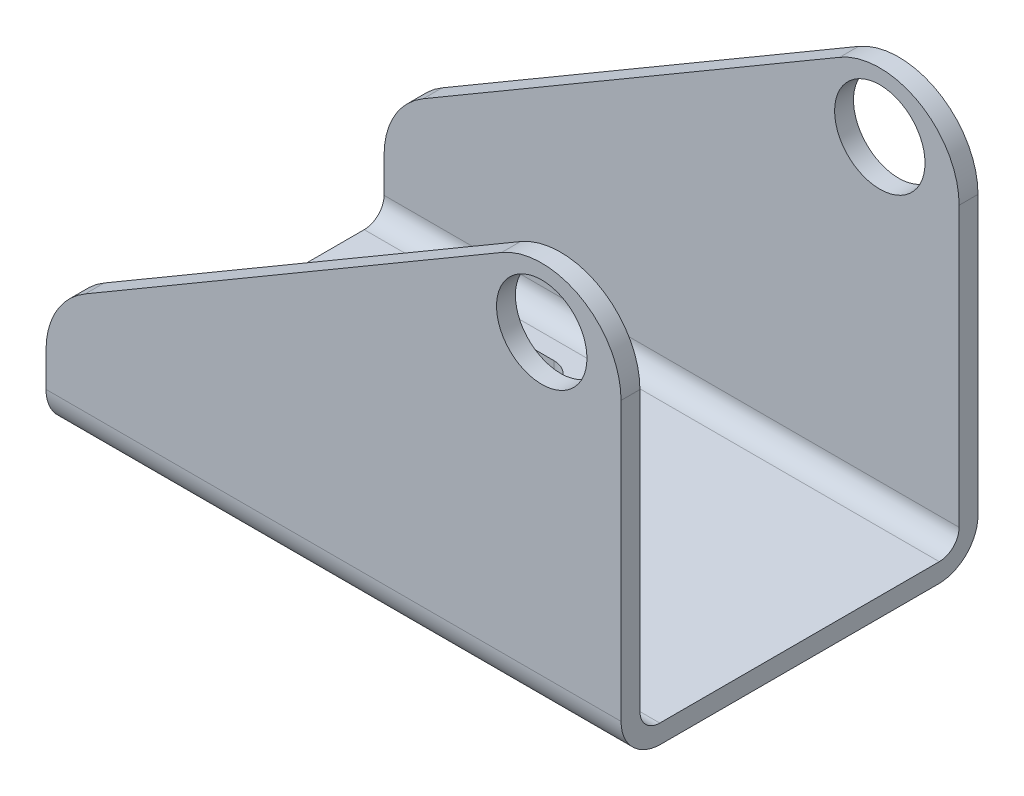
ISO-10303-21;
HEADER;
FILE_DESCRIPTION(('STEP AP214'),'2;1');
FILE_NAME('part.step','',(''),(''),'','','');
FILE_SCHEMA(('AUTOMOTIVE_DESIGN { 1 0 10303 214 1 1 1 1 }'));
ENDSEC;
DATA;
#1=APPLICATION_CONTEXT('core data for automotive mechanical design processes');
#2=APPLICATION_PROTOCOL_DEFINITION('international standard','automotive_design',2000,#1);
#3=PRODUCT_CONTEXT('',#1,'mechanical');
#4=PRODUCT('Part','Part','',(#3));
#5=PRODUCT_RELATED_PRODUCT_CATEGORY('part','',(#4));
#6=PRODUCT_DEFINITION_FORMATION('','',#4);
#7=PRODUCT_DEFINITION_CONTEXT('part definition',#1,'design');
#8=PRODUCT_DEFINITION('design','',#6,#7);
#9=PRODUCT_DEFINITION_SHAPE('','',#8);
#10=(LENGTH_UNIT() NAMED_UNIT(*) SI_UNIT(.MILLI.,.METRE.));
#11=(NAMED_UNIT(*) PLANE_ANGLE_UNIT() SI_UNIT($,.RADIAN.));
#12=(NAMED_UNIT(*) SI_UNIT($,.STERADIAN.) SOLID_ANGLE_UNIT());
#13=UNCERTAINTY_MEASURE_WITH_UNIT(LENGTH_MEASURE(1.E-05),#10,'distance_accuracy_value','');
#14=(GEOMETRIC_REPRESENTATION_CONTEXT(3) GLOBAL_UNCERTAINTY_ASSIGNED_CONTEXT((#13)) GLOBAL_UNIT_ASSIGNED_CONTEXT((#10,
#11,#12)) REPRESENTATION_CONTEXT('',''));
#15=CARTESIAN_POINT('',(0.,0.,0.));
#16=DIRECTION('',(0.,0.,1.));
#17=DIRECTION('',(1.,0.,0.));
#18=AXIS2_PLACEMENT_3D('',#15,#16,#17);
#19=CARTESIAN_POINT('',(0.,0.,-28.575));
#20=DIRECTION('',(0.,0.,-1.));
#21=DIRECTION('',(-1.,0.,0.));
#22=AXIS2_PLACEMENT_3D('',#19,#20,#21);
#23=PLANE('',#22);
#24=DIRECTION('',(0.,1.,0.));
#25=VECTOR('',#24,1.);
#26=CARTESIAN_POINT('',(92.075,73.025,-28.575));
#27=LINE('',#26,#25);
#28=CARTESIAN_POINT('',(92.075,6.35000000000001,-28.575));
#29=VERTEX_POINT('',#28);
#30=CARTESIAN_POINT('',(92.075,50.8589137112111,-28.575));
#31=VERTEX_POINT('',#30);
#32=EDGE_CURVE('E332',#29,#31,#27,.T.);
#33=ORIENTED_EDGE('',*,*,#32,.F.);
#34=DIRECTION('',(1.,0.,0.));
#35=VECTOR('',#34,1.);
#36=CARTESIAN_POINT('',(0.,6.35,-28.575));
#37=LINE('',#36,#35);
#38=CARTESIAN_POINT('',(0.,6.35,-28.575));
#39=VERTEX_POINT('',#38);
#40=EDGE_CURVE('E402',#29,#39,#37,.F.);
#41=ORIENTED_EDGE('',*,*,#40,.T.);
#42=DIRECTION('',(0.,-1.,0.));
#43=VECTOR('',#42,1.);
#44=CARTESIAN_POINT('',(0.,0.,-28.575));
#45=LINE('',#44,#43);
#46=CARTESIAN_POINT('',(0.,11.7735688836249,-28.575));
#47=VERTEX_POINT('',#46);
#48=EDGE_CURVE('E342',#47,#39,#45,.T.);
#49=ORIENTED_EDGE('',*,*,#48,.F.);
#50=CARTESIAN_POINT('',(12.7,11.7735688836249,-28.575));
#51=DIRECTION('',(0.,0.,-1.));
#52=DIRECTION('',(-1.,0.,0.));
#53=AXIS2_PLACEMENT_3D('',#50,#51,#52);
#54=CIRCLE('',#53,12.7);
#55=CARTESIAN_POINT('',(6.27736235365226,22.7298331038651,-28.575));
#56=VERTEX_POINT('',#55);
#57=EDGE_CURVE('E376',#47,#56,#54,.T.);
#58=ORIENTED_EDGE('',*,*,#57,.T.);
#59=DIRECTION('',(-0.862697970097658,-0.50571949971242,0.));
#60=VECTOR('',#59,1.);
#61=CARTESIAN_POINT('',(0.,19.05,-28.575));
#62=LINE('',#61,#60);
#63=CARTESIAN_POINT('',(72.9523623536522,61.8151779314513,-28.575));
#64=VERTEX_POINT('',#63);
#65=EDGE_CURVE('E339',#64,#56,#62,.T.);
#66=ORIENTED_EDGE('',*,*,#65,.F.);
#67=CARTESIAN_POINT('',(79.375,50.8589137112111,-28.575));
#68=DIRECTION('',(0.,0.,-1.));
#69=DIRECTION('',(-1.,0.,0.));
#70=AXIS2_PLACEMENT_3D('',#67,#68,#69);
#71=CIRCLE('',#70,12.7);
#72=EDGE_CURVE('E363',#64,#31,#71,.T.);
#73=ORIENTED_EDGE('',*,*,#72,.T.);
#74=EDGE_LOOP('',(#33,#41,#49,#58,#66,#73));
#75=FACE_BOUND('',#74,.T.);
#76=CARTESIAN_POINT('',(79.375,53.975,-28.575));
#77=DIRECTION('',(0.,0.,1.));
#78=DIRECTION('',(1.,0.,0.));
#79=AXIS2_PLACEMENT_3D('',#76,#77,#78);
#80=CIRCLE('',#79,7.23899999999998);
#81=CARTESIAN_POINT('',(86.614,53.975,-28.575));
#82=VERTEX_POINT('',#81);
#83=EDGE_CURVE('E288',#82,#82,#80,.T.);
#84=ORIENTED_EDGE('',*,*,#83,.T.);
#85=EDGE_LOOP('',(#84));
#86=FACE_BOUND('',#85,.T.);
#87=ADVANCED_FACE('F31',(#75,#86),#23,.T.);
#88=CARTESIAN_POINT('',(92.075,73.025,28.575));
#89=DIRECTION('',(-1.,0.,0.));
#90=DIRECTION('',(0.,-1.,0.));
#91=AXIS2_PLACEMENT_3D('',#88,#89,#90);
#92=PLANE('',#91);
#93=DIRECTION('',(0.,1.,0.));
#94=VECTOR('',#93,1.);
#95=CARTESIAN_POINT('',(92.075,73.025,28.575));
#96=LINE('',#95,#94);
#97=CARTESIAN_POINT('',(92.075,6.35000000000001,28.575));
#98=VERTEX_POINT('',#97);
#99=CARTESIAN_POINT('',(92.075,50.8589137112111,28.575));
#100=VERTEX_POINT('',#99);
#101=EDGE_CURVE('E345',#98,#100,#96,.T.);
#102=ORIENTED_EDGE('',*,*,#101,.F.);
#103=CARTESIAN_POINT('',(92.075,6.35,22.225));
#104=DIRECTION('',(-1.,0.,0.));
#105=DIRECTION('',(0.,-1.,0.));
#106=AXIS2_PLACEMENT_3D('',#103,#104,#105);
#107=CIRCLE('',#106,6.35);
#108=CARTESIAN_POINT('',(92.075,0.,22.225));
#109=VERTEX_POINT('',#108);
#110=EDGE_CURVE('E391',#98,#109,#107,.F.);
#111=ORIENTED_EDGE('',*,*,#110,.T.);
#112=DIRECTION('',(0.,0.,-1.));
#113=VECTOR('',#112,1.);
#114=CARTESIAN_POINT('',(92.075,0.,28.575));
#115=LINE('',#114,#113);
#116=CARTESIAN_POINT('',(92.075,0.,-22.225));
#117=VERTEX_POINT('',#116);
#118=EDGE_CURVE('E356',#109,#117,#115,.T.);
#119=ORIENTED_EDGE('',*,*,#118,.T.);
#120=CARTESIAN_POINT('',(92.075,6.35,-22.225));
#121=DIRECTION('',(-1.,0.,0.));
#122=DIRECTION('',(0.,-1.,0.));
#123=AXIS2_PLACEMENT_3D('',#120,#121,#122);
#124=CIRCLE('',#123,6.35);
#125=EDGE_CURVE('E389',#117,#29,#124,.F.);
#126=ORIENTED_EDGE('',*,*,#125,.T.);
#127=ORIENTED_EDGE('',*,*,#32,.T.);
#128=DIRECTION('',(0.,0.,-1.));
#129=VECTOR('',#128,1.);
#130=CARTESIAN_POINT('',(92.075,50.8589137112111,28.575));
#131=LINE('',#130,#129);
#132=CARTESIAN_POINT('',(92.075,50.8589137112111,-25.5524));
#133=VERTEX_POINT('',#132);
#134=EDGE_CURVE('E367',#31,#133,#131,.F.);
#135=ORIENTED_EDGE('',*,*,#134,.T.);
#136=DIRECTION('',(0.,1.,0.));
#137=VECTOR('',#136,1.);
#138=CARTESIAN_POINT('',(92.075,0.,-25.5524));
#139=LINE('',#138,#137);
#140=CARTESIAN_POINT('',(92.075,6.1976,-25.5524));
#141=VERTEX_POINT('',#140);
#142=EDGE_CURVE('E304',#141,#133,#139,.T.);
#143=ORIENTED_EDGE('',*,*,#142,.F.);
#144=CARTESIAN_POINT('',(92.075,6.1976,-22.3774));
#145=DIRECTION('',(-1.,0.,0.));
#146=DIRECTION('',(0.,-1.,0.));
#147=AXIS2_PLACEMENT_3D('',#144,#145,#146);
#148=CIRCLE('',#147,3.175);
#149=CARTESIAN_POINT('',(92.075,3.0226,-22.3774));
#150=VERTEX_POINT('',#149);
#151=EDGE_CURVE('E414',#141,#150,#148,.T.);
#152=ORIENTED_EDGE('',*,*,#151,.T.);
#153=DIRECTION('',(0.,0.,-1.));
#154=VECTOR('',#153,1.);
#155=CARTESIAN_POINT('',(92.075,3.0226,28.575));
#156=LINE('',#155,#154);
#157=CARTESIAN_POINT('',(92.075,3.0226,22.3774));
#158=VERTEX_POINT('',#157);
#159=EDGE_CURVE('E305',#158,#150,#156,.T.);
#160=ORIENTED_EDGE('',*,*,#159,.F.);
#161=CARTESIAN_POINT('',(92.075,6.1976,22.3774));
#162=DIRECTION('',(-1.,0.,0.));
#163=DIRECTION('',(0.,-1.,0.));
#164=AXIS2_PLACEMENT_3D('',#161,#162,#163);
#165=CIRCLE('',#164,3.175);
#166=CARTESIAN_POINT('',(92.075,6.1976,25.5524));
#167=VERTEX_POINT('',#166);
#168=EDGE_CURVE('E418',#158,#167,#165,.T.);
#169=ORIENTED_EDGE('',*,*,#168,.T.);
#170=DIRECTION('',(0.,1.,0.));
#171=VECTOR('',#170,1.);
#172=CARTESIAN_POINT('',(92.075,0.,25.5524));
#173=LINE('',#172,#171);
#174=CARTESIAN_POINT('',(92.075,50.8589137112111,25.5524));
#175=VERTEX_POINT('',#174);
#176=EDGE_CURVE('E323',#167,#175,#173,.T.);
#177=ORIENTED_EDGE('',*,*,#176,.T.);
#178=EDGE_CURVE('E366',#175,#100,#131,.F.);
#179=ORIENTED_EDGE('',*,*,#178,.T.);
#180=EDGE_LOOP('',(#102,#111,#119,#126,#127,#135,#143,#152,#160,#169,#177,#179));
#181=FACE_BOUND('',#180,.T.);
#182=ADVANCED_FACE('F518',(#181),#92,.F.);
#183=CARTESIAN_POINT('',(0.,19.05,28.575));
#184=DIRECTION('',(0.50571949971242,-0.862697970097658,0.));
#185=DIRECTION('',(0.862697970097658,0.50571949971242,0.));
#186=AXIS2_PLACEMENT_3D('',#183,#184,#185);
#187=PLANE('',#186);
#188=DIRECTION('',(-0.862697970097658,-0.50571949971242,0.));
#189=VECTOR('',#188,1.);
#190=CARTESIAN_POINT('',(-8.31119469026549,14.1779203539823,-25.5524));
#191=LINE('',#190,#189);
#192=CARTESIAN_POINT('',(72.9523623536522,61.8151779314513,-25.5524));
#193=VERTEX_POINT('',#192);
#194=CARTESIAN_POINT('',(6.27736235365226,22.7298331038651,-25.5524));
#195=VERTEX_POINT('',#194);
#196=EDGE_CURVE('E311',#193,#195,#191,.T.);
#197=ORIENTED_EDGE('',*,*,#196,.F.);
#198=DIRECTION('',(0.,0.,-1.));
#199=VECTOR('',#198,1.);
#200=CARTESIAN_POINT('',(72.9523623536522,61.8151779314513,28.575));
#201=LINE('',#200,#199);
#202=EDGE_CURVE('E359',#193,#64,#201,.T.);
#203=ORIENTED_EDGE('',*,*,#202,.T.);
#204=ORIENTED_EDGE('',*,*,#65,.T.);
#205=DIRECTION('',(0.,0.,-1.));
#206=VECTOR('',#205,1.);
#207=CARTESIAN_POINT('',(6.27736235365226,22.7298331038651,28.575));
#208=LINE('',#207,#206);
#209=EDGE_CURVE('E379',#56,#195,#208,.F.);
#210=ORIENTED_EDGE('',*,*,#209,.T.);
#211=EDGE_LOOP('',(#197,#203,#204,#210));
#212=FACE_BOUND('',#211,.T.);
#213=ADVANCED_FACE('F510',(#212),#187,.F.);
#214=CARTESIAN_POINT('',(79.375,50.8589137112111,28.575));
#215=DIRECTION('',(0.,0.,-1.));
#216=DIRECTION('',(-1.,0.,0.));
#217=AXIS2_PLACEMENT_3D('',#214,#215,#216);
#218=CYLINDRICAL_SURFACE('',#217,12.7);
#219=ORIENTED_EDGE('',*,*,#178,.F.);
#220=CARTESIAN_POINT('',(79.375,50.8589137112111,25.5524));
#221=DIRECTION('',(0.,0.,-1.));
#222=DIRECTION('',(-1.,0.,0.));
#223=AXIS2_PLACEMENT_3D('',#220,#221,#222);
#224=CIRCLE('',#223,12.7);
#225=CARTESIAN_POINT('',(72.9523623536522,61.8151779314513,25.5524));
#226=VERTEX_POINT('',#225);
#227=EDGE_CURVE('E314',#175,#226,#224,.F.);
#228=ORIENTED_EDGE('',*,*,#227,.T.);
#229=CARTESIAN_POINT('',(72.9523623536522,61.8151779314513,28.575));
#230=VERTEX_POINT('',#229);
#231=EDGE_CURVE('E360',#230,#226,#201,.T.);
#232=ORIENTED_EDGE('',*,*,#231,.F.);
#233=CARTESIAN_POINT('',(79.375,50.8589137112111,28.575));
#234=DIRECTION('',(0.,0.,-1.));
#235=DIRECTION('',(-1.,0.,0.));
#236=AXIS2_PLACEMENT_3D('',#233,#234,#235);
#237=CIRCLE('',#236,12.7);
#238=EDGE_CURVE('E370',#100,#230,#237,.F.);
#239=ORIENTED_EDGE('',*,*,#238,.F.);
#240=EDGE_LOOP('',(#219,#228,#232,#239));
#241=FACE_BOUND('',#240,.T.);
#242=ADVANCED_FACE('F529',(#241),#218,.T.);
#243=ORIENTED_EDGE('',*,*,#202,.F.);
#244=CARTESIAN_POINT('',(79.375,50.8589137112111,-25.5524));
#245=DIRECTION('',(0.,0.,-1.));
#246=DIRECTION('',(-1.,0.,0.));
#247=AXIS2_PLACEMENT_3D('',#244,#245,#246);
#248=CIRCLE('',#247,12.7);
#249=EDGE_CURVE('E308',#193,#133,#248,.T.);
#250=ORIENTED_EDGE('',*,*,#249,.T.);
#251=ORIENTED_EDGE('',*,*,#134,.F.);
#252=ORIENTED_EDGE('',*,*,#72,.F.);
#253=EDGE_LOOP('',(#243,#250,#251,#252));
#254=FACE_BOUND('',#253,.T.);
#255=ADVANCED_FACE('F595',(#254),#218,.T.);
#256=CARTESIAN_POINT('',(12.7,11.7735688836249,28.575));
#257=DIRECTION('',(0.,0.,-1.));
#258=DIRECTION('',(-1.,0.,0.));
#259=AXIS2_PLACEMENT_3D('',#256,#257,#258);
#260=CYLINDRICAL_SURFACE('',#259,12.7);
#261=CARTESIAN_POINT('',(6.27736235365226,22.7298331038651,25.5524));
#262=VERTEX_POINT('',#261);
#263=CARTESIAN_POINT('',(6.27736235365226,22.7298331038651,28.575));
#264=VERTEX_POINT('',#263);
#265=EDGE_CURVE('E378',#262,#264,#208,.F.);
#266=ORIENTED_EDGE('',*,*,#265,.F.);
#267=CARTESIAN_POINT('',(12.7,11.7735688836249,25.5524));
#268=DIRECTION('',(0.,0.,-1.));
#269=DIRECTION('',(-1.,0.,0.));
#270=AXIS2_PLACEMENT_3D('',#267,#268,#269);
#271=CIRCLE('',#270,12.7);
#272=CARTESIAN_POINT('',(0.,11.7735688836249,25.5524));
#273=VERTEX_POINT('',#272);
#274=EDGE_CURVE('E320',#262,#273,#271,.F.);
#275=ORIENTED_EDGE('',*,*,#274,.T.);
#276=DIRECTION('',(0.,0.,-1.));
#277=VECTOR('',#276,1.);
#278=CARTESIAN_POINT('',(0.,11.7735688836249,28.575));
#279=LINE('',#278,#277);
#280=CARTESIAN_POINT('',(0.,11.7735688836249,28.575));
#281=VERTEX_POINT('',#280);
#282=EDGE_CURVE('E373',#281,#273,#279,.T.);
#283=ORIENTED_EDGE('',*,*,#282,.F.);
#284=CARTESIAN_POINT('',(12.7,11.7735688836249,28.575));
#285=DIRECTION('',(0.,0.,-1.));
#286=DIRECTION('',(-1.,0.,0.));
#287=AXIS2_PLACEMENT_3D('',#284,#285,#286);
#288=CIRCLE('',#287,12.7);
#289=EDGE_CURVE('E382',#264,#281,#288,.F.);
#290=ORIENTED_EDGE('',*,*,#289,.F.);
#291=EDGE_LOOP('',(#266,#275,#283,#290));
#292=FACE_BOUND('',#291,.T.);
#293=ADVANCED_FACE('F511',(#292),#260,.T.);
#294=CARTESIAN_POINT('',(0.,11.7735688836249,-25.5524));
#295=VERTEX_POINT('',#294);
#296=EDGE_CURVE('E372',#295,#47,#279,.T.);
#297=ORIENTED_EDGE('',*,*,#296,.F.);
#298=CARTESIAN_POINT('',(12.7,11.7735688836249,-25.5524));
#299=DIRECTION('',(0.,0.,-1.));
#300=DIRECTION('',(-1.,0.,0.));
#301=AXIS2_PLACEMENT_3D('',#298,#299,#300);
#302=CIRCLE('',#301,12.7);
#303=EDGE_CURVE('E317',#295,#195,#302,.T.);
#304=ORIENTED_EDGE('',*,*,#303,.T.);
#305=ORIENTED_EDGE('',*,*,#209,.F.);
#306=ORIENTED_EDGE('',*,*,#57,.F.);
#307=EDGE_LOOP('',(#297,#304,#305,#306));
#308=FACE_BOUND('',#307,.T.);
#309=ADVANCED_FACE('F500',(#308),#260,.T.);
#310=CARTESIAN_POINT('',(92.075,0.,28.575));
#311=DIRECTION('',(0.,1.,0.));
#312=DIRECTION('',(-1.,0.,0.));
#313=AXIS2_PLACEMENT_3D('',#310,#311,#312);
#314=PLANE('',#313);
#315=DIRECTION('',(1.,0.,0.));
#316=VECTOR('',#315,1.);
#317=CARTESIAN_POINT('',(26.9875,0.,12.3444));
#318=LINE('',#317,#316);
#319=CARTESIAN_POINT('',(26.9875,0.,12.3444));
#320=VERTEX_POINT('',#319);
#321=CARTESIAN_POINT('',(33.3375,0.,12.3444));
#322=VERTEX_POINT('',#321);
#323=EDGE_CURVE('E252',#320,#322,#318,.T.);
#324=ORIENTED_EDGE('',*,*,#323,.F.);
#325=CARTESIAN_POINT('',(26.9875,0.,15.875));
#326=DIRECTION('',(0.,-1.,0.));
#327=DIRECTION('',(1.,0.,0.));
#328=AXIS2_PLACEMENT_3D('',#325,#326,#327);
#329=CIRCLE('',#328,3.53059999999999);
#330=CARTESIAN_POINT('',(26.9875,0.,19.4056));
#331=VERTEX_POINT('',#330);
#332=EDGE_CURVE('E261',#331,#320,#329,.T.);
#333=ORIENTED_EDGE('',*,*,#332,.F.);
#334=DIRECTION('',(-1.,0.,0.));
#335=VECTOR('',#334,1.);
#336=CARTESIAN_POINT('',(26.9875,0.,19.4056));
#337=LINE('',#336,#335);
#338=CARTESIAN_POINT('',(33.3375,0.,19.4056));
#339=VERTEX_POINT('',#338);
#340=EDGE_CURVE('E271',#339,#331,#337,.T.);
#341=ORIENTED_EDGE('',*,*,#340,.F.);
#342=CARTESIAN_POINT('',(33.3375,0.,15.875));
#343=DIRECTION('',(0.,-1.,0.));
#344=DIRECTION('',(-1.,0.,0.));
#345=AXIS2_PLACEMENT_3D('',#342,#343,#344);
#346=CIRCLE('',#345,3.53059999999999);
#347=EDGE_CURVE('E900',#322,#339,#346,.T.);
#348=ORIENTED_EDGE('',*,*,#347,.F.);
#349=EDGE_LOOP('',(#324,#333,#341,#348));
#350=FACE_BOUND('',#349,.T.);
#351=DIRECTION('',(1.,0.,0.));
#352=VECTOR('',#351,1.);
#353=CARTESIAN_POINT('',(7.9375,0.,12.3444));
#354=LINE('',#353,#352);
#355=CARTESIAN_POINT('',(7.9375,0.,12.3444));
#356=VERTEX_POINT('',#355);
#357=CARTESIAN_POINT('',(14.2875,0.,12.3444));
#358=VERTEX_POINT('',#357);
#359=EDGE_CURVE('E276',#356,#358,#354,.T.);
#360=ORIENTED_EDGE('',*,*,#359,.F.);
#361=CARTESIAN_POINT('',(7.9375,0.,15.875));
#362=DIRECTION('',(0.,-1.,0.));
#363=DIRECTION('',(1.,0.,0.));
#364=AXIS2_PLACEMENT_3D('',#361,#362,#363);
#365=CIRCLE('',#364,3.53059999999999);
#366=CARTESIAN_POINT('',(7.9375,0.,19.4056));
#367=VERTEX_POINT('',#366);
#368=EDGE_CURVE('E269',#367,#356,#365,.T.);
#369=ORIENTED_EDGE('',*,*,#368,.F.);
#370=DIRECTION('',(-1.,0.,0.));
#371=VECTOR('',#370,1.);
#372=CARTESIAN_POINT('',(7.9375,0.,19.4056));
#373=LINE('',#372,#371);
#374=CARTESIAN_POINT('',(14.2875,0.,19.4056));
#375=VERTEX_POINT('',#374);
#376=EDGE_CURVE('E282',#375,#367,#373,.T.);
#377=ORIENTED_EDGE('',*,*,#376,.F.);
#378=CARTESIAN_POINT('',(14.2875,0.,15.875));
#379=DIRECTION('',(0.,-1.,0.));
#380=DIRECTION('',(-1.,0.,0.));
#381=AXIS2_PLACEMENT_3D('',#378,#379,#380);
#382=CIRCLE('',#381,3.53059999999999);
#383=EDGE_CURVE('E279',#358,#375,#382,.T.);
#384=ORIENTED_EDGE('',*,*,#383,.F.);
#385=EDGE_LOOP('',(#360,#369,#377,#384));
#386=FACE_BOUND('',#385,.T.);
#387=ORIENTED_EDGE('',*,*,#118,.F.);
#388=DIRECTION('',(1.,0.,0.));
#389=VECTOR('',#388,1.);
#390=CARTESIAN_POINT('',(92.075,0.,22.225));
#391=LINE('',#390,#389);
#392=CARTESIAN_POINT('',(0.,0.,22.225));
#393=VERTEX_POINT('',#392);
#394=EDGE_CURVE('E396',#109,#393,#391,.F.);
#395=ORIENTED_EDGE('',*,*,#394,.T.);
#396=DIRECTION('',(0.,0.,-1.));
#397=VECTOR('',#396,1.);
#398=CARTESIAN_POINT('',(0.,0.,28.575));
#399=LINE('',#398,#397);
#400=CARTESIAN_POINT('',(0.,0.,-22.225));
#401=VERTEX_POINT('',#400);
#402=EDGE_CURVE('E353',#393,#401,#399,.T.);
#403=ORIENTED_EDGE('',*,*,#402,.T.);
#404=DIRECTION('',(1.,0.,0.));
#405=VECTOR('',#404,1.);
#406=CARTESIAN_POINT('',(92.075,0.,-22.225));
#407=LINE('',#406,#405);
#408=EDGE_CURVE('E393',#401,#117,#407,.T.);
#409=ORIENTED_EDGE('',*,*,#408,.T.);
#410=EDGE_LOOP('',(#387,#395,#403,#409));
#411=FACE_BOUND('',#410,.T.);
#412=CARTESIAN_POINT('',(7.9375,0.,-15.875));
#413=DIRECTION('',(0.,-1.,0.));
#414=DIRECTION('',(1.,0.,0.));
#415=AXIS2_PLACEMENT_3D('',#412,#413,#414);
#416=CIRCLE('',#415,3.53059999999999);
#417=CARTESIAN_POINT('',(7.9375,0.,-12.3444));
#418=VERTEX_POINT('',#417);
#419=CARTESIAN_POINT('',(7.9375,0.,-19.4056));
#420=VERTEX_POINT('',#419);
#421=EDGE_CURVE('E442',#418,#420,#416,.T.);
#422=ORIENTED_EDGE('',*,*,#421,.F.);
#423=DIRECTION('',(-1.,0.,0.));
#424=VECTOR('',#423,1.);
#425=CARTESIAN_POINT('',(7.9375,0.,-12.3444));
#426=LINE('',#425,#424);
#427=CARTESIAN_POINT('',(14.2875,0.,-12.3444));
#428=VERTEX_POINT('',#427);
#429=EDGE_CURVE('E444',#428,#418,#426,.T.);
#430=ORIENTED_EDGE('',*,*,#429,.F.);
#431=CARTESIAN_POINT('',(14.2875,0.,-15.875));
#432=DIRECTION('',(0.,-1.,0.));
#433=DIRECTION('',(-1.,0.,0.));
#434=AXIS2_PLACEMENT_3D('',#431,#432,#433);
#435=CIRCLE('',#434,3.53059999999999);
#436=CARTESIAN_POINT('',(14.2875,0.,-19.4056));
#437=VERTEX_POINT('',#436);
#438=EDGE_CURVE('E447',#437,#428,#435,.T.);
#439=ORIENTED_EDGE('',*,*,#438,.F.);
#440=DIRECTION('',(1.,0.,0.));
#441=VECTOR('',#440,1.);
#442=CARTESIAN_POINT('',(7.9375,0.,-19.4056));
#443=LINE('',#442,#441);
#444=EDGE_CURVE('E450',#420,#437,#443,.T.);
#445=ORIENTED_EDGE('',*,*,#444,.F.);
#446=EDGE_LOOP('',(#422,#430,#439,#445));
#447=FACE_BOUND('',#446,.T.);
#448=CARTESIAN_POINT('',(26.9875,0.,-15.875));
#449=DIRECTION('',(0.,-1.,0.));
#450=DIRECTION('',(1.,0.,0.));
#451=AXIS2_PLACEMENT_3D('',#448,#449,#450);
#452=CIRCLE('',#451,3.53059999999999);
#453=CARTESIAN_POINT('',(26.9875,0.,-12.3444));
#454=VERTEX_POINT('',#453);
#455=CARTESIAN_POINT('',(26.9875,0.,-19.4056));
#456=VERTEX_POINT('',#455);
#457=EDGE_CURVE('E46',#454,#456,#452,.T.);
#458=ORIENTED_EDGE('',*,*,#457,.F.);
#459=DIRECTION('',(-1.,0.,0.));
#460=VECTOR('',#459,1.);
#461=CARTESIAN_POINT('',(26.9875,0.,-12.3444));
#462=LINE('',#461,#460);
#463=CARTESIAN_POINT('',(33.3375,0.,-12.3444));
#464=VERTEX_POINT('',#463);
#465=EDGE_CURVE('E477',#464,#454,#462,.T.);
#466=ORIENTED_EDGE('',*,*,#465,.F.);
#467=CARTESIAN_POINT('',(33.3375,0.,-15.875));
#468=DIRECTION('',(0.,-1.,0.));
#469=DIRECTION('',(-1.,0.,0.));
#470=AXIS2_PLACEMENT_3D('',#467,#468,#469);
#471=CIRCLE('',#470,3.53059999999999);
#472=CARTESIAN_POINT('',(33.3375,0.,-19.4056));
#473=VERTEX_POINT('',#472);
#474=EDGE_CURVE('E53',#473,#464,#471,.T.);
#475=ORIENTED_EDGE('',*,*,#474,.F.);
#476=DIRECTION('',(1.,0.,0.));
#477=VECTOR('',#476,1.);
#478=CARTESIAN_POINT('',(26.9875,0.,-19.4056));
#479=LINE('',#478,#477);
#480=EDGE_CURVE('E481',#456,#473,#479,.T.);
#481=ORIENTED_EDGE('',*,*,#480,.F.);
#482=EDGE_LOOP('',(#458,#466,#475,#481));
#483=FACE_BOUND('',#482,.T.);
#484=ADVANCED_FACE('F497',(#350,#386,#411,#447,#483),#314,.F.);
#485=ORIENTED_EDGE('',*,*,#231,.T.);
#486=DIRECTION('',(-0.862697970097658,-0.50571949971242,0.));
#487=VECTOR('',#486,1.);
#488=CARTESIAN_POINT('',(-8.31119469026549,14.1779203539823,25.5524));
#489=LINE('',#488,#487);
#490=EDGE_CURVE('E329',#226,#262,#489,.T.);
#491=ORIENTED_EDGE('',*,*,#490,.T.);
#492=ORIENTED_EDGE('',*,*,#265,.T.);
#493=DIRECTION('',(-0.862697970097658,-0.50571949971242,0.));
#494=VECTOR('',#493,1.);
#495=CARTESIAN_POINT('',(0.,19.05,28.575));
#496=LINE('',#495,#494);
#497=EDGE_CURVE('E347',#230,#264,#496,.T.);
#498=ORIENTED_EDGE('',*,*,#497,.F.);
#499=EDGE_LOOP('',(#485,#491,#492,#498));
#500=FACE_BOUND('',#499,.T.);
#501=ADVANCED_FACE('F499',(#500),#187,.F.);
#502=CARTESIAN_POINT('',(0.,0.,28.575));
#503=DIRECTION('',(1.,0.,0.));
#504=DIRECTION('',(0.,0.,-1.));
#505=AXIS2_PLACEMENT_3D('',#502,#503,#504);
#506=PLANE('',#505);
#507=ORIENTED_EDGE('',*,*,#402,.F.);
#508=CARTESIAN_POINT('',(0.,6.35,22.225));
#509=DIRECTION('',(1.,0.,0.));
#510=DIRECTION('',(0.,0.,-1.));
#511=AXIS2_PLACEMENT_3D('',#508,#509,#510);
#512=CIRCLE('',#511,6.35);
#513=CARTESIAN_POINT('',(0.,6.35,28.575));
#514=VERTEX_POINT('',#513);
#515=EDGE_CURVE('E400',#393,#514,#512,.F.);
#516=ORIENTED_EDGE('',*,*,#515,.T.);
#517=DIRECTION('',(0.,-1.,0.));
#518=VECTOR('',#517,1.);
#519=CARTESIAN_POINT('',(0.,0.,28.575));
#520=LINE('',#519,#518);
#521=EDGE_CURVE('E350',#281,#514,#520,.T.);
#522=ORIENTED_EDGE('',*,*,#521,.F.);
#523=ORIENTED_EDGE('',*,*,#282,.T.);
#524=DIRECTION('',(0.,-1.,0.));
#525=VECTOR('',#524,1.);
#526=CARTESIAN_POINT('',(0.,0.,25.5524));
#527=LINE('',#526,#525);
#528=CARTESIAN_POINT('',(0.,6.1976,25.5524));
#529=VERTEX_POINT('',#528);
#530=EDGE_CURVE('E326',#273,#529,#527,.T.);
#531=ORIENTED_EDGE('',*,*,#530,.T.);
#532=CARTESIAN_POINT('',(0.,6.1976,22.3774));
#533=DIRECTION('',(1.,0.,0.));
#534=DIRECTION('',(0.,0.,-1.));
#535=AXIS2_PLACEMENT_3D('',#532,#533,#534);
#536=CIRCLE('',#535,3.175);
#537=CARTESIAN_POINT('',(0.,3.0226,22.3774));
#538=VERTEX_POINT('',#537);
#539=EDGE_CURVE('E420',#529,#538,#536,.T.);
#540=ORIENTED_EDGE('',*,*,#539,.T.);
#541=DIRECTION('',(0.,0.,-1.));
#542=VECTOR('',#541,1.);
#543=CARTESIAN_POINT('',(0.,3.0226,28.575));
#544=LINE('',#543,#542);
#545=CARTESIAN_POINT('',(0.,3.0226,-22.3774));
#546=VERTEX_POINT('',#545);
#547=EDGE_CURVE('E309',#538,#546,#544,.T.);
#548=ORIENTED_EDGE('',*,*,#547,.T.);
#549=CARTESIAN_POINT('',(0.,6.1976,-22.3774));
#550=DIRECTION('',(1.,0.,0.));
#551=DIRECTION('',(0.,0.,-1.));
#552=AXIS2_PLACEMENT_3D('',#549,#550,#551);
#553=CIRCLE('',#552,3.175);
#554=CARTESIAN_POINT('',(0.,6.1976,-25.5524));
#555=VERTEX_POINT('',#554);
#556=EDGE_CURVE('E416',#546,#555,#553,.T.);
#557=ORIENTED_EDGE('',*,*,#556,.T.);
#558=DIRECTION('',(0.,-1.,0.));
#559=VECTOR('',#558,1.);
#560=CARTESIAN_POINT('',(0.,0.,-25.5524));
#561=LINE('',#560,#559);
#562=EDGE_CURVE('E316',#295,#555,#561,.T.);
#563=ORIENTED_EDGE('',*,*,#562,.F.);
#564=ORIENTED_EDGE('',*,*,#296,.T.);
#565=ORIENTED_EDGE('',*,*,#48,.T.);
#566=CARTESIAN_POINT('',(0.,6.35,-22.225));
#567=DIRECTION('',(1.,0.,0.));
#568=DIRECTION('',(0.,0.,-1.));
#569=AXIS2_PLACEMENT_3D('',#566,#567,#568);
#570=CIRCLE('',#569,6.35);
#571=EDGE_CURVE('E398',#39,#401,#570,.F.);
#572=ORIENTED_EDGE('',*,*,#571,.T.);
#573=EDGE_LOOP('',(#507,#516,#522,#523,#531,#540,#548,#557,#563,#564,#565,#572));
#574=FACE_BOUND('',#573,.T.);
#575=ADVANCED_FACE('F507',(#574),#506,.F.);
#576=CARTESIAN_POINT('',(0.,0.,28.575));
#577=DIRECTION('',(0.,0.,-1.));
#578=DIRECTION('',(-1.,0.,0.));
#579=AXIS2_PLACEMENT_3D('',#576,#577,#578);
#580=PLANE('',#579);
#581=CARTESIAN_POINT('',(79.375,53.975,28.575));
#582=DIRECTION('',(0.,0.,1.));
#583=DIRECTION('',(1.,0.,0.));
#584=AXIS2_PLACEMENT_3D('',#581,#582,#583);
#585=CIRCLE('',#584,7.239);
#586=CARTESIAN_POINT('',(86.614,53.975,28.575));
#587=VERTEX_POINT('',#586);
#588=EDGE_CURVE('E297',#587,#587,#585,.T.);
#589=ORIENTED_EDGE('',*,*,#588,.F.);
#590=EDGE_LOOP('',(#589));
#591=FACE_BOUND('',#590,.T.);
#592=ORIENTED_EDGE('',*,*,#521,.T.);
#593=DIRECTION('',(1.,0.,0.));
#594=VECTOR('',#593,1.);
#595=CARTESIAN_POINT('',(0.,6.35,28.575));
#596=LINE('',#595,#594);
#597=EDGE_CURVE('E384',#514,#98,#596,.T.);
#598=ORIENTED_EDGE('',*,*,#597,.T.);
#599=ORIENTED_EDGE('',*,*,#101,.T.);
#600=ORIENTED_EDGE('',*,*,#238,.T.);
#601=ORIENTED_EDGE('',*,*,#497,.T.);
#602=ORIENTED_EDGE('',*,*,#289,.T.);
#603=EDGE_LOOP('',(#592,#598,#599,#600,#601,#602));
#604=FACE_BOUND('',#603,.T.);
#605=ADVANCED_FACE('F530',(#591,#604),#580,.F.);
#606=CARTESIAN_POINT('',(92.075,3.0226,28.575));
#607=DIRECTION('',(0.,1.,0.));
#608=DIRECTION('',(-1.,0.,0.));
#609=AXIS2_PLACEMENT_3D('',#606,#607,#608);
#610=PLANE('',#609);
#611=CARTESIAN_POINT('',(26.9875,3.0226,15.875));
#612=DIRECTION('',(0.,1.,0.));
#613=DIRECTION('',(-1.,0.,0.));
#614=AXIS2_PLACEMENT_3D('',#611,#612,#613);
#615=CIRCLE('',#614,3.53059999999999);
#616=CARTESIAN_POINT('',(26.9875,3.0226,12.3444));
#617=VERTEX_POINT('',#616);
#618=CARTESIAN_POINT('',(26.9875,3.0226,19.4056));
#619=VERTEX_POINT('',#618);
#620=EDGE_CURVE('E258',#617,#619,#615,.T.);
#621=ORIENTED_EDGE('',*,*,#620,.F.);
#622=DIRECTION('',(-1.,0.,0.));
#623=VECTOR('',#622,1.);
#624=CARTESIAN_POINT('',(111.125,3.02260000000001,12.3444));
#625=LINE('',#624,#623);
#626=CARTESIAN_POINT('',(33.3375,3.0226,12.3444));
#627=VERTEX_POINT('',#626);
#628=EDGE_CURVE('E242',#627,#617,#625,.T.);
#629=ORIENTED_EDGE('',*,*,#628,.F.);
#630=CARTESIAN_POINT('',(33.3375,3.0226,15.875));
#631=DIRECTION('',(0.,1.,0.));
#632=DIRECTION('',(-1.,0.,0.));
#633=AXIS2_PLACEMENT_3D('',#630,#631,#632);
#634=CIRCLE('',#633,3.53059999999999);
#635=CARTESIAN_POINT('',(33.3375,3.0226,19.4056));
#636=VERTEX_POINT('',#635);
#637=EDGE_CURVE('E896',#636,#627,#634,.T.);
#638=ORIENTED_EDGE('',*,*,#637,.F.);
#639=DIRECTION('',(1.,0.,0.));
#640=VECTOR('',#639,1.);
#641=CARTESIAN_POINT('',(111.125,3.02260000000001,19.4056));
#642=LINE('',#641,#640);
#643=EDGE_CURVE('E266',#619,#636,#642,.T.);
#644=ORIENTED_EDGE('',*,*,#643,.F.);
#645=EDGE_LOOP('',(#621,#629,#638,#644));
#646=FACE_BOUND('',#645,.T.);
#647=CARTESIAN_POINT('',(7.9375,3.0226,15.875));
#648=DIRECTION('',(0.,1.,0.));
#649=DIRECTION('',(-1.,0.,0.));
#650=AXIS2_PLACEMENT_3D('',#647,#648,#649);
#651=CIRCLE('',#650,3.53059999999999);
#652=CARTESIAN_POINT('',(7.9375,3.0226,12.3444));
#653=VERTEX_POINT('',#652);
#654=CARTESIAN_POINT('',(7.9375,3.0226,19.4056));
#655=VERTEX_POINT('',#654);
#656=EDGE_CURVE('E429',#653,#655,#651,.T.);
#657=ORIENTED_EDGE('',*,*,#656,.F.);
#658=DIRECTION('',(-1.,0.,0.));
#659=VECTOR('',#658,1.);
#660=CARTESIAN_POINT('',(92.075,3.0226,12.3444));
#661=LINE('',#660,#659);
#662=CARTESIAN_POINT('',(14.2875,3.0226,12.3444));
#663=VERTEX_POINT('',#662);
#664=EDGE_CURVE('E422',#663,#653,#661,.T.);
#665=ORIENTED_EDGE('',*,*,#664,.F.);
#666=CARTESIAN_POINT('',(14.2875,3.0226,15.875));
#667=DIRECTION('',(0.,1.,0.));
#668=DIRECTION('',(-1.,0.,0.));
#669=AXIS2_PLACEMENT_3D('',#666,#667,#668);
#670=CIRCLE('',#669,3.53059999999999);
#671=CARTESIAN_POINT('',(14.2875,3.0226,19.4056));
#672=VERTEX_POINT('',#671);
#673=EDGE_CURVE('E424',#672,#663,#670,.T.);
#674=ORIENTED_EDGE('',*,*,#673,.F.);
#675=DIRECTION('',(1.,0.,0.));
#676=VECTOR('',#675,1.);
#677=CARTESIAN_POINT('',(92.075,3.0226,19.4056));
#678=LINE('',#677,#676);
#679=EDGE_CURVE('E427',#655,#672,#678,.T.);
#680=ORIENTED_EDGE('',*,*,#679,.F.);
#681=EDGE_LOOP('',(#657,#665,#674,#680));
#682=FACE_BOUND('',#681,.T.);
#683=ORIENTED_EDGE('',*,*,#159,.T.);
#684=DIRECTION('',(1.,0.,0.));
#685=VECTOR('',#684,1.);
#686=CARTESIAN_POINT('',(92.075,3.0226,-22.3774));
#687=LINE('',#686,#685);
#688=EDGE_CURVE('E410',#150,#546,#687,.F.);
#689=ORIENTED_EDGE('',*,*,#688,.T.);
#690=ORIENTED_EDGE('',*,*,#547,.F.);
#691=DIRECTION('',(1.,0.,0.));
#692=VECTOR('',#691,1.);
#693=CARTESIAN_POINT('',(92.075,3.0226,22.3774));
#694=LINE('',#693,#692);
#695=EDGE_CURVE('E407',#538,#158,#694,.T.);
#696=ORIENTED_EDGE('',*,*,#695,.T.);
#697=EDGE_LOOP('',(#683,#689,#690,#696));
#698=FACE_BOUND('',#697,.T.);
#699=CARTESIAN_POINT('',(7.9375,3.0226,-15.875));
#700=DIRECTION('',(0.,1.,0.));
#701=DIRECTION('',(-1.,0.,0.));
#702=AXIS2_PLACEMENT_3D('',#699,#700,#701);
#703=CIRCLE('',#702,3.53059999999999);
#704=CARTESIAN_POINT('',(7.9375,3.0226,-19.4056));
#705=VERTEX_POINT('',#704);
#706=CARTESIAN_POINT('',(7.9375,3.0226,-12.3444));
#707=VERTEX_POINT('',#706);
#708=EDGE_CURVE('E431',#705,#707,#703,.T.);
#709=ORIENTED_EDGE('',*,*,#708,.F.);
#710=DIRECTION('',(-1.,0.,0.));
#711=VECTOR('',#710,1.);
#712=CARTESIAN_POINT('',(92.075,3.0226,-19.4056));
#713=LINE('',#712,#711);
#714=CARTESIAN_POINT('',(14.2875,3.0226,-19.4056));
#715=VERTEX_POINT('',#714);
#716=EDGE_CURVE('E433',#715,#705,#713,.T.);
#717=ORIENTED_EDGE('',*,*,#716,.F.);
#718=CARTESIAN_POINT('',(14.2875,3.0226,-15.875));
#719=DIRECTION('',(0.,1.,0.));
#720=DIRECTION('',(-1.,0.,0.));
#721=AXIS2_PLACEMENT_3D('',#718,#719,#720);
#722=CIRCLE('',#721,3.53059999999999);
#723=CARTESIAN_POINT('',(14.2875,3.0226,-12.3444));
#724=VERTEX_POINT('',#723);
#725=EDGE_CURVE('E436',#724,#715,#722,.T.);
#726=ORIENTED_EDGE('',*,*,#725,.F.);
#727=DIRECTION('',(1.,0.,0.));
#728=VECTOR('',#727,1.);
#729=CARTESIAN_POINT('',(92.075,3.0226,-12.3444));
#730=LINE('',#729,#728);
#731=EDGE_CURVE('E439',#707,#724,#730,.T.);
#732=ORIENTED_EDGE('',*,*,#731,.F.);
#733=EDGE_LOOP('',(#709,#717,#726,#732));
#734=FACE_BOUND('',#733,.T.);
#735=CARTESIAN_POINT('',(26.9875,3.0226,-15.875));
#736=DIRECTION('',(0.,1.,0.));
#737=DIRECTION('',(-1.,0.,0.));
#738=AXIS2_PLACEMENT_3D('',#735,#736,#737);
#739=CIRCLE('',#738,3.53059999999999);
#740=CARTESIAN_POINT('',(26.9875,3.0226,-19.4056));
#741=VERTEX_POINT('',#740);
#742=CARTESIAN_POINT('',(26.9875,3.0226,-12.3444));
#743=VERTEX_POINT('',#742);
#744=EDGE_CURVE('E465',#741,#743,#739,.T.);
#745=ORIENTED_EDGE('',*,*,#744,.F.);
#746=DIRECTION('',(-1.,0.,0.));
#747=VECTOR('',#746,1.);
#748=CARTESIAN_POINT('',(111.125,3.02260000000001,-19.4056));
#749=LINE('',#748,#747);
#750=CARTESIAN_POINT('',(33.3375,3.0226,-19.4056));
#751=VERTEX_POINT('',#750);
#752=EDGE_CURVE('E467',#751,#741,#749,.T.);
#753=ORIENTED_EDGE('',*,*,#752,.F.);
#754=CARTESIAN_POINT('',(33.3375,3.0226,-15.875));
#755=DIRECTION('',(0.,1.,0.));
#756=DIRECTION('',(-1.,0.,0.));
#757=AXIS2_PLACEMENT_3D('',#754,#755,#756);
#758=CIRCLE('',#757,3.53059999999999);
#759=CARTESIAN_POINT('',(33.3375,3.0226,-12.3444));
#760=VERTEX_POINT('',#759);
#761=EDGE_CURVE('E470',#760,#751,#758,.T.);
#762=ORIENTED_EDGE('',*,*,#761,.F.);
#763=DIRECTION('',(1.,0.,0.));
#764=VECTOR('',#763,1.);
#765=CARTESIAN_POINT('',(111.125,3.02260000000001,-12.3444));
#766=LINE('',#765,#764);
#767=EDGE_CURVE('E473',#743,#760,#766,.T.);
#768=ORIENTED_EDGE('',*,*,#767,.F.);
#769=EDGE_LOOP('',(#745,#753,#762,#768));
#770=FACE_BOUND('',#769,.T.);
#771=ADVANCED_FACE('F263',(#646,#682,#698,#734,#770),#610,.T.);
#772=CARTESIAN_POINT('',(0.,0.,25.5524));
#773=DIRECTION('',(0.,0.,-1.));
#774=DIRECTION('',(-1.,0.,0.));
#775=AXIS2_PLACEMENT_3D('',#772,#773,#774);
#776=PLANE('',#775);
#777=CARTESIAN_POINT('',(79.375,53.975,25.5524));
#778=DIRECTION('',(0.,0.,-1.));
#779=DIRECTION('',(-1.,0.,0.));
#780=AXIS2_PLACEMENT_3D('',#777,#778,#779);
#781=CIRCLE('',#780,7.23899999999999);
#782=CARTESIAN_POINT('',(72.136,53.975,25.5524));
#783=VERTEX_POINT('',#782);
#784=EDGE_CURVE('E301',#783,#783,#781,.T.);
#785=ORIENTED_EDGE('',*,*,#784,.F.);
#786=EDGE_LOOP('',(#785));
#787=FACE_BOUND('',#786,.T.);
#788=ORIENTED_EDGE('',*,*,#176,.F.);
#789=DIRECTION('',(1.,0.,0.));
#790=VECTOR('',#789,1.);
#791=CARTESIAN_POINT('',(0.,6.1976,25.5524));
#792=LINE('',#791,#790);
#793=EDGE_CURVE('E412',#167,#529,#792,.F.);
#794=ORIENTED_EDGE('',*,*,#793,.T.);
#795=ORIENTED_EDGE('',*,*,#530,.F.);
#796=ORIENTED_EDGE('',*,*,#274,.F.);
#797=ORIENTED_EDGE('',*,*,#490,.F.);
#798=ORIENTED_EDGE('',*,*,#227,.F.);
#799=EDGE_LOOP('',(#788,#794,#795,#796,#797,#798));
#800=FACE_BOUND('',#799,.T.);
#801=ADVANCED_FACE('F614',(#787,#800),#776,.T.);
#802=CARTESIAN_POINT('',(0.,0.,-25.5524));
#803=DIRECTION('',(0.,0.,-1.));
#804=DIRECTION('',(-1.,0.,0.));
#805=AXIS2_PLACEMENT_3D('',#802,#803,#804);
#806=PLANE('',#805);
#807=CARTESIAN_POINT('',(79.375,53.975,-25.5524));
#808=DIRECTION('',(0.,0.,-1.));
#809=DIRECTION('',(-1.,0.,0.));
#810=AXIS2_PLACEMENT_3D('',#807,#808,#809);
#811=CIRCLE('',#810,7.23899999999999);
#812=CARTESIAN_POINT('',(72.136,53.975,-25.5524));
#813=VERTEX_POINT('',#812);
#814=EDGE_CURVE('E300',#813,#813,#811,.T.);
#815=ORIENTED_EDGE('',*,*,#814,.T.);
#816=EDGE_LOOP('',(#815));
#817=FACE_BOUND('',#816,.T.);
#818=ORIENTED_EDGE('',*,*,#562,.T.);
#819=DIRECTION('',(1.,0.,0.));
#820=VECTOR('',#819,1.);
#821=CARTESIAN_POINT('',(0.,6.1976,-25.5524));
#822=LINE('',#821,#820);
#823=EDGE_CURVE('E404',#555,#141,#822,.T.);
#824=ORIENTED_EDGE('',*,*,#823,.T.);
#825=ORIENTED_EDGE('',*,*,#142,.T.);
#826=ORIENTED_EDGE('',*,*,#249,.F.);
#827=ORIENTED_EDGE('',*,*,#196,.T.);
#828=ORIENTED_EDGE('',*,*,#303,.F.);
#829=EDGE_LOOP('',(#818,#824,#825,#826,#827,#828));
#830=FACE_BOUND('',#829,.T.);
#831=ADVANCED_FACE('F580',(#817,#830),#806,.F.);
#832=CARTESIAN_POINT('',(79.375,53.975,28.575));
#833=DIRECTION('',(0.,0.,1.));
#834=DIRECTION('',(1.,0.,0.));
#835=AXIS2_PLACEMENT_3D('',#832,#833,#834);
#836=CYLINDRICAL_SURFACE('',#835,7.23899999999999);
#837=ORIENTED_EDGE('',*,*,#83,.F.);
#838=EDGE_LOOP('',(#837));
#839=FACE_BOUND('',#838,.T.);
#840=ORIENTED_EDGE('',*,*,#814,.F.);
#841=EDGE_LOOP('',(#840));
#842=FACE_BOUND('',#841,.T.);
#843=ADVANCED_FACE('F613',(#839,#842),#836,.F.);
#844=ORIENTED_EDGE('',*,*,#784,.T.);
#845=EDGE_LOOP('',(#844));
#846=FACE_BOUND('',#845,.T.);
#847=ORIENTED_EDGE('',*,*,#588,.T.);
#848=EDGE_LOOP('',(#847));
#849=FACE_BOUND('',#848,.T.);
#850=ADVANCED_FACE('F621',(#846,#849),#836,.F.);
#851=CARTESIAN_POINT('',(0.,6.35,22.225));
#852=DIRECTION('',(1.,0.,0.));
#853=DIRECTION('',(0.,1.,0.));
#854=AXIS2_PLACEMENT_3D('',#851,#852,#853);
#855=CYLINDRICAL_SURFACE('',#854,6.35);
#856=ORIENTED_EDGE('',*,*,#515,.F.);
#857=ORIENTED_EDGE('',*,*,#394,.F.);
#858=ORIENTED_EDGE('',*,*,#110,.F.);
#859=ORIENTED_EDGE('',*,*,#597,.F.);
#860=EDGE_LOOP('',(#856,#857,#858,#859));
#861=FACE_BOUND('',#860,.T.);
#862=ADVANCED_FACE('F547',(#861),#855,.T.);
#863=CARTESIAN_POINT('',(92.075,6.35,-22.225));
#864=DIRECTION('',(-1.,0.,0.));
#865=DIRECTION('',(0.,-1.,0.));
#866=AXIS2_PLACEMENT_3D('',#863,#864,#865);
#867=CYLINDRICAL_SURFACE('',#866,6.35);
#868=ORIENTED_EDGE('',*,*,#571,.F.);
#869=ORIENTED_EDGE('',*,*,#40,.F.);
#870=ORIENTED_EDGE('',*,*,#125,.F.);
#871=ORIENTED_EDGE('',*,*,#408,.F.);
#872=EDGE_LOOP('',(#868,#869,#870,#871));
#873=FACE_BOUND('',#872,.T.);
#874=ADVANCED_FACE('F589',(#873),#867,.T.);
#875=CARTESIAN_POINT('',(0.,6.1976,-22.3774));
#876=DIRECTION('',(1.,0.,0.));
#877=DIRECTION('',(0.,1.,0.));
#878=AXIS2_PLACEMENT_3D('',#875,#876,#877);
#879=CYLINDRICAL_SURFACE('',#878,3.175);
#880=ORIENTED_EDGE('',*,*,#556,.F.);
#881=ORIENTED_EDGE('',*,*,#688,.F.);
#882=ORIENTED_EDGE('',*,*,#151,.F.);
#883=ORIENTED_EDGE('',*,*,#823,.F.);
#884=EDGE_LOOP('',(#880,#881,#882,#883));
#885=FACE_BOUND('',#884,.T.);
#886=ADVANCED_FACE('F578',(#885),#879,.F.);
#887=CARTESIAN_POINT('',(92.075,6.1976,22.3774));
#888=DIRECTION('',(-1.,0.,0.));
#889=DIRECTION('',(0.,-1.,0.));
#890=AXIS2_PLACEMENT_3D('',#887,#888,#889);
#891=CYLINDRICAL_SURFACE('',#890,3.175);
#892=ORIENTED_EDGE('',*,*,#539,.F.);
#893=ORIENTED_EDGE('',*,*,#793,.F.);
#894=ORIENTED_EDGE('',*,*,#168,.F.);
#895=ORIENTED_EDGE('',*,*,#695,.F.);
#896=EDGE_LOOP('',(#892,#893,#894,#895));
#897=FACE_BOUND('',#896,.T.);
#898=ADVANCED_FACE('F569',(#897),#891,.F.);
#899=CARTESIAN_POINT('',(7.93749999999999,63.5589137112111,15.875));
#900=DIRECTION('',(0.,-1.,0.));
#901=DIRECTION('',(1.,0.,0.));
#902=AXIS2_PLACEMENT_3D('',#899,#900,#901);
#903=CYLINDRICAL_SURFACE('',#902,3.53059999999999);
#904=ORIENTED_EDGE('',*,*,#656,.T.);
#905=DIRECTION('',(0.,-1.,0.));
#906=VECTOR('',#905,1.);
#907=CARTESIAN_POINT('',(7.93749999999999,63.5589137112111,19.4056));
#908=LINE('',#907,#906);
#909=EDGE_CURVE('E286',#655,#367,#908,.T.);
#910=ORIENTED_EDGE('',*,*,#909,.T.);
#911=ORIENTED_EDGE('',*,*,#368,.T.);
#912=DIRECTION('',(0.,-1.,0.));
#913=VECTOR('',#912,1.);
#914=CARTESIAN_POINT('',(7.93749999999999,63.5589137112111,12.3444));
#915=LINE('',#914,#913);
#916=EDGE_CURVE('E285',#653,#356,#915,.T.);
#917=ORIENTED_EDGE('',*,*,#916,.F.);
#918=EDGE_LOOP('',(#904,#910,#911,#917));
#919=FACE_BOUND('',#918,.T.);
#920=ADVANCED_FACE('F633',(#919),#903,.F.);
#921=CARTESIAN_POINT('',(7.93749999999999,63.5589137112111,19.4056));
#922=DIRECTION('',(0.,0.,1.));
#923=DIRECTION('',(1.,0.,0.));
#924=AXIS2_PLACEMENT_3D('',#921,#922,#923);
#925=PLANE('',#924);
#926=ORIENTED_EDGE('',*,*,#679,.T.);
#927=DIRECTION('',(0.,-1.,0.));
#928=VECTOR('',#927,1.);
#929=CARTESIAN_POINT('',(14.2875,63.5589137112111,19.4056));
#930=LINE('',#929,#928);
#931=EDGE_CURVE('E289',#672,#375,#930,.T.);
#932=ORIENTED_EDGE('',*,*,#931,.T.);
#933=ORIENTED_EDGE('',*,*,#376,.T.);
#934=ORIENTED_EDGE('',*,*,#909,.F.);
#935=EDGE_LOOP('',(#926,#932,#933,#934));
#936=FACE_BOUND('',#935,.T.);
#937=ADVANCED_FACE('F636',(#936),#925,.F.);
#938=CARTESIAN_POINT('',(14.2875,63.5589137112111,15.875));
#939=DIRECTION('',(0.,-1.,0.));
#940=DIRECTION('',(1.,0.,0.));
#941=AXIS2_PLACEMENT_3D('',#938,#939,#940);
#942=CYLINDRICAL_SURFACE('',#941,3.53059999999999);
#943=ORIENTED_EDGE('',*,*,#673,.T.);
#944=DIRECTION('',(0.,-1.,0.));
#945=VECTOR('',#944,1.);
#946=CARTESIAN_POINT('',(14.2875,63.5589137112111,12.3444));
#947=LINE('',#946,#945);
#948=EDGE_CURVE('E291',#663,#358,#947,.T.);
#949=ORIENTED_EDGE('',*,*,#948,.T.);
#950=ORIENTED_EDGE('',*,*,#383,.T.);
#951=ORIENTED_EDGE('',*,*,#931,.F.);
#952=EDGE_LOOP('',(#943,#949,#950,#951));
#953=FACE_BOUND('',#952,.T.);
#954=ADVANCED_FACE('F641',(#953),#942,.F.);
#955=CARTESIAN_POINT('',(7.93749999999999,63.5589137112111,12.3444));
#956=DIRECTION('',(0.,0.,-1.));
#957=DIRECTION('',(-1.,0.,0.));
#958=AXIS2_PLACEMENT_3D('',#955,#956,#957);
#959=PLANE('',#958);
#960=ORIENTED_EDGE('',*,*,#664,.T.);
#961=ORIENTED_EDGE('',*,*,#916,.T.);
#962=ORIENTED_EDGE('',*,*,#359,.T.);
#963=ORIENTED_EDGE('',*,*,#948,.F.);
#964=EDGE_LOOP('',(#960,#961,#962,#963));
#965=FACE_BOUND('',#964,.T.);
#966=ADVANCED_FACE('F638',(#965),#959,.F.);
#967=CARTESIAN_POINT('',(26.9875,63.5589137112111,15.875));
#968=DIRECTION('',(0.,-1.,0.));
#969=DIRECTION('',(1.,0.,0.));
#970=AXIS2_PLACEMENT_3D('',#967,#968,#969);
#971=CYLINDRICAL_SURFACE('',#970,3.53059999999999);
#972=ORIENTED_EDGE('',*,*,#620,.T.);
#973=DIRECTION('',(0.,-1.,0.));
#974=VECTOR('',#973,1.);
#975=CARTESIAN_POINT('',(26.9875,63.5589137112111,19.4056));
#976=LINE('',#975,#974);
#977=EDGE_CURVE('E267',#619,#331,#976,.T.);
#978=ORIENTED_EDGE('',*,*,#977,.T.);
#979=ORIENTED_EDGE('',*,*,#332,.T.);
#980=DIRECTION('',(0.,-1.,0.));
#981=VECTOR('',#980,1.);
#982=CARTESIAN_POINT('',(26.9875,63.5589137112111,12.3444));
#983=LINE('',#982,#981);
#984=EDGE_CURVE('E245',#617,#320,#983,.T.);
#985=ORIENTED_EDGE('',*,*,#984,.F.);
#986=EDGE_LOOP('',(#972,#978,#979,#985));
#987=FACE_BOUND('',#986,.T.);
#988=ADVANCED_FACE('F256',(#987),#971,.F.);
#989=CARTESIAN_POINT('',(26.9875,63.5589137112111,19.4056));
#990=DIRECTION('',(0.,0.,1.));
#991=DIRECTION('',(1.,0.,0.));
#992=AXIS2_PLACEMENT_3D('',#989,#990,#991);
#993=PLANE('',#992);
#994=ORIENTED_EDGE('',*,*,#643,.T.);
#995=DIRECTION('',(0.,-1.,0.));
#996=VECTOR('',#995,1.);
#997=CARTESIAN_POINT('',(33.3375,63.5589137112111,19.4056));
#998=LINE('',#997,#996);
#999=EDGE_CURVE('E899',#636,#339,#998,.T.);
#1000=ORIENTED_EDGE('',*,*,#999,.T.);
#1001=ORIENTED_EDGE('',*,*,#340,.T.);
#1002=ORIENTED_EDGE('',*,*,#977,.F.);
#1003=EDGE_LOOP('',(#994,#1000,#1001,#1002));
#1004=FACE_BOUND('',#1003,.T.);
#1005=ADVANCED_FACE('F651',(#1004),#993,.F.);
#1006=CARTESIAN_POINT('',(33.3375,63.5589137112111,15.875));
#1007=DIRECTION('',(0.,-1.,0.));
#1008=DIRECTION('',(1.,0.,0.));
#1009=AXIS2_PLACEMENT_3D('',#1006,#1007,#1008);
#1010=CYLINDRICAL_SURFACE('',#1009,3.53059999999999);
#1011=ORIENTED_EDGE('',*,*,#637,.T.);
#1012=DIRECTION('',(0.,-1.,0.));
#1013=VECTOR('',#1012,1.);
#1014=CARTESIAN_POINT('',(33.3375,63.5589137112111,12.3444));
#1015=LINE('',#1014,#1013);
#1016=EDGE_CURVE('E248',#627,#322,#1015,.T.);
#1017=ORIENTED_EDGE('',*,*,#1016,.T.);
#1018=ORIENTED_EDGE('',*,*,#347,.T.);
#1019=ORIENTED_EDGE('',*,*,#999,.F.);
#1020=EDGE_LOOP('',(#1011,#1017,#1018,#1019));
#1021=FACE_BOUND('',#1020,.T.);
#1022=ADVANCED_FACE('F655',(#1021),#1010,.F.);
#1023=CARTESIAN_POINT('',(26.9875,63.5589137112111,12.3444));
#1024=DIRECTION('',(0.,0.,-1.));
#1025=DIRECTION('',(-1.,0.,0.));
#1026=AXIS2_PLACEMENT_3D('',#1023,#1024,#1025);
#1027=PLANE('',#1026);
#1028=ORIENTED_EDGE('',*,*,#628,.T.);
#1029=ORIENTED_EDGE('',*,*,#984,.T.);
#1030=ORIENTED_EDGE('',*,*,#323,.T.);
#1031=ORIENTED_EDGE('',*,*,#1016,.F.);
#1032=EDGE_LOOP('',(#1028,#1029,#1030,#1031));
#1033=FACE_BOUND('',#1032,.T.);
#1034=ADVANCED_FACE('F244',(#1033),#1027,.F.);
#1035=CARTESIAN_POINT('',(7.9375,63.5589137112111,-19.4056));
#1036=DIRECTION('',(0.,0.,-1.));
#1037=DIRECTION('',(-1.,0.,0.));
#1038=AXIS2_PLACEMENT_3D('',#1035,#1036,#1037);
#1039=PLANE('',#1038);
#1040=ORIENTED_EDGE('',*,*,#716,.T.);
#1041=DIRECTION('',(0.,-1.,0.));
#1042=VECTOR('',#1041,1.);
#1043=CARTESIAN_POINT('',(7.9375,63.5589137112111,-19.4056));
#1044=LINE('',#1043,#1042);
#1045=EDGE_CURVE('E456',#705,#420,#1044,.T.);
#1046=ORIENTED_EDGE('',*,*,#1045,.T.);
#1047=ORIENTED_EDGE('',*,*,#444,.T.);
#1048=DIRECTION('',(0.,-1.,0.));
#1049=VECTOR('',#1048,1.);
#1050=CARTESIAN_POINT('',(14.2875,63.5589137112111,-19.4056));
#1051=LINE('',#1050,#1049);
#1052=EDGE_CURVE('E462',#715,#437,#1051,.T.);
#1053=ORIENTED_EDGE('',*,*,#1052,.F.);
#1054=EDGE_LOOP('',(#1040,#1046,#1047,#1053));
#1055=FACE_BOUND('',#1054,.T.);
#1056=ADVANCED_FACE('F652',(#1055),#1039,.F.);
#1057=CARTESIAN_POINT('',(14.2875,63.5589137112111,-15.875));
#1058=DIRECTION('',(0.,-1.,0.));
#1059=DIRECTION('',(1.,0.,0.));
#1060=AXIS2_PLACEMENT_3D('',#1057,#1058,#1059);
#1061=CYLINDRICAL_SURFACE('',#1060,3.53059999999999);
#1062=ORIENTED_EDGE('',*,*,#725,.T.);
#1063=ORIENTED_EDGE('',*,*,#1052,.T.);
#1064=ORIENTED_EDGE('',*,*,#438,.T.);
#1065=DIRECTION('',(0.,-1.,0.));
#1066=VECTOR('',#1065,1.);
#1067=CARTESIAN_POINT('',(14.2875,63.5589137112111,-12.3444));
#1068=LINE('',#1067,#1066);
#1069=EDGE_CURVE('E459',#724,#428,#1068,.T.);
#1070=ORIENTED_EDGE('',*,*,#1069,.F.);
#1071=EDGE_LOOP('',(#1062,#1063,#1064,#1070));
#1072=FACE_BOUND('',#1071,.T.);
#1073=ADVANCED_FACE('F664',(#1072),#1061,.F.);
#1074=CARTESIAN_POINT('',(7.9375,63.5589137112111,-12.3444));
#1075=DIRECTION('',(0.,0.,1.));
#1076=DIRECTION('',(1.,0.,0.));
#1077=AXIS2_PLACEMENT_3D('',#1074,#1075,#1076);
#1078=PLANE('',#1077);
#1079=ORIENTED_EDGE('',*,*,#731,.T.);
#1080=ORIENTED_EDGE('',*,*,#1069,.T.);
#1081=ORIENTED_EDGE('',*,*,#429,.T.);
#1082=DIRECTION('',(0.,-1.,0.));
#1083=VECTOR('',#1082,1.);
#1084=CARTESIAN_POINT('',(7.9375,63.5589137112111,-12.3444));
#1085=LINE('',#1084,#1083);
#1086=EDGE_CURVE('E453',#707,#418,#1085,.T.);
#1087=ORIENTED_EDGE('',*,*,#1086,.F.);
#1088=EDGE_LOOP('',(#1079,#1080,#1081,#1087));
#1089=FACE_BOUND('',#1088,.T.);
#1090=ADVANCED_FACE('F670',(#1089),#1078,.F.);
#1091=CARTESIAN_POINT('',(7.9375,63.5589137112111,-15.875));
#1092=DIRECTION('',(0.,-1.,0.));
#1093=DIRECTION('',(1.,0.,0.));
#1094=AXIS2_PLACEMENT_3D('',#1091,#1092,#1093);
#1095=CYLINDRICAL_SURFACE('',#1094,3.53059999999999);
#1096=ORIENTED_EDGE('',*,*,#708,.T.);
#1097=ORIENTED_EDGE('',*,*,#1086,.T.);
#1098=ORIENTED_EDGE('',*,*,#421,.T.);
#1099=ORIENTED_EDGE('',*,*,#1045,.F.);
#1100=EDGE_LOOP('',(#1096,#1097,#1098,#1099));
#1101=FACE_BOUND('',#1100,.T.);
#1102=ADVANCED_FACE('F683',(#1101),#1095,.F.);
#1103=CARTESIAN_POINT('',(26.9875,63.5589137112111,-19.4056));
#1104=DIRECTION('',(0.,0.,-1.));
#1105=DIRECTION('',(-1.,0.,0.));
#1106=AXIS2_PLACEMENT_3D('',#1103,#1104,#1105);
#1107=PLANE('',#1106);
#1108=ORIENTED_EDGE('',*,*,#752,.T.);
#1109=DIRECTION('',(0.,-1.,0.));
#1110=VECTOR('',#1109,1.);
#1111=CARTESIAN_POINT('',(26.9875,63.5589137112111,-19.4056));
#1112=LINE('',#1111,#1110);
#1113=EDGE_CURVE('E485',#741,#456,#1112,.T.);
#1114=ORIENTED_EDGE('',*,*,#1113,.T.);
#1115=ORIENTED_EDGE('',*,*,#480,.T.);
#1116=DIRECTION('',(0.,-1.,0.));
#1117=VECTOR('',#1116,1.);
#1118=CARTESIAN_POINT('',(33.3375,63.5589137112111,-19.4056));
#1119=LINE('',#1118,#1117);
#1120=EDGE_CURVE('E11',#751,#473,#1119,.T.);
#1121=ORIENTED_EDGE('',*,*,#1120,.F.);
#1122=EDGE_LOOP('',(#1108,#1114,#1115,#1121));
#1123=FACE_BOUND('',#1122,.T.);
#1124=ADVANCED_FACE('F33',(#1123),#1107,.F.);
#1125=CARTESIAN_POINT('',(33.3375,63.5589137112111,-15.875));
#1126=DIRECTION('',(0.,-1.,0.));
#1127=DIRECTION('',(1.,0.,0.));
#1128=AXIS2_PLACEMENT_3D('',#1125,#1126,#1127);
#1129=CYLINDRICAL_SURFACE('',#1128,3.53059999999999);
#1130=ORIENTED_EDGE('',*,*,#761,.T.);
#1131=ORIENTED_EDGE('',*,*,#1120,.T.);
#1132=ORIENTED_EDGE('',*,*,#474,.T.);
#1133=DIRECTION('',(0.,-1.,0.));
#1134=VECTOR('',#1133,1.);
#1135=CARTESIAN_POINT('',(33.3375,63.5589137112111,-12.3444));
#1136=LINE('',#1135,#1134);
#1137=EDGE_CURVE('E39',#760,#464,#1136,.T.);
#1138=ORIENTED_EDGE('',*,*,#1137,.F.);
#1139=EDGE_LOOP('',(#1130,#1131,#1132,#1138));
#1140=FACE_BOUND('',#1139,.T.);
#1141=ADVANCED_FACE('F494',(#1140),#1129,.F.);
#1142=CARTESIAN_POINT('',(26.9875,63.5589137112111,-12.3444));
#1143=DIRECTION('',(0.,0.,1.));
#1144=DIRECTION('',(1.,0.,0.));
#1145=AXIS2_PLACEMENT_3D('',#1142,#1143,#1144);
#1146=PLANE('',#1145);
#1147=ORIENTED_EDGE('',*,*,#767,.T.);
#1148=ORIENTED_EDGE('',*,*,#1137,.T.);
#1149=ORIENTED_EDGE('',*,*,#465,.T.);
#1150=DIRECTION('',(0.,-1.,0.));
#1151=VECTOR('',#1150,1.);
#1152=CARTESIAN_POINT('',(26.9875,63.5589137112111,-12.3444));
#1153=LINE('',#1152,#1151);
#1154=EDGE_CURVE('E483',#743,#454,#1153,.T.);
#1155=ORIENTED_EDGE('',*,*,#1154,.F.);
#1156=EDGE_LOOP('',(#1147,#1148,#1149,#1155));
#1157=FACE_BOUND('',#1156,.T.);
#1158=ADVANCED_FACE('F490',(#1157),#1146,.F.);
#1159=CARTESIAN_POINT('',(26.9875,63.5589137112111,-15.875));
#1160=DIRECTION('',(0.,-1.,0.));
#1161=DIRECTION('',(1.,0.,0.));
#1162=AXIS2_PLACEMENT_3D('',#1159,#1160,#1161);
#1163=CYLINDRICAL_SURFACE('',#1162,3.53059999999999);
#1164=ORIENTED_EDGE('',*,*,#744,.T.);
#1165=ORIENTED_EDGE('',*,*,#1154,.T.);
#1166=ORIENTED_EDGE('',*,*,#457,.T.);
#1167=ORIENTED_EDGE('',*,*,#1113,.F.);
#1168=EDGE_LOOP('',(#1164,#1165,#1166,#1167));
#1169=FACE_BOUND('',#1168,.T.);
#1170=ADVANCED_FACE('F675',(#1169),#1163,.F.);
#1171=CLOSED_SHELL('',(#87,#182,#213,#242,#255,#293,#309,#484,#501,#575,#605,#771,#801,#831,
#843,#850,#862,#874,#886,#898,#920,#937,#954,#966,#988,#1005,#1022,#1034,#1056,#1073,#1090,
#1102,#1124,#1141,#1158,#1170));
#1172=MANIFOLD_SOLID_BREP('B2',#1171);
#1173=ADVANCED_BREP_SHAPE_REPRESENTATION('',(#18,#1172),#14);
#1174=SHAPE_DEFINITION_REPRESENTATION(#9,#1173);
ENDSEC;
END-ISO-10303-21;
